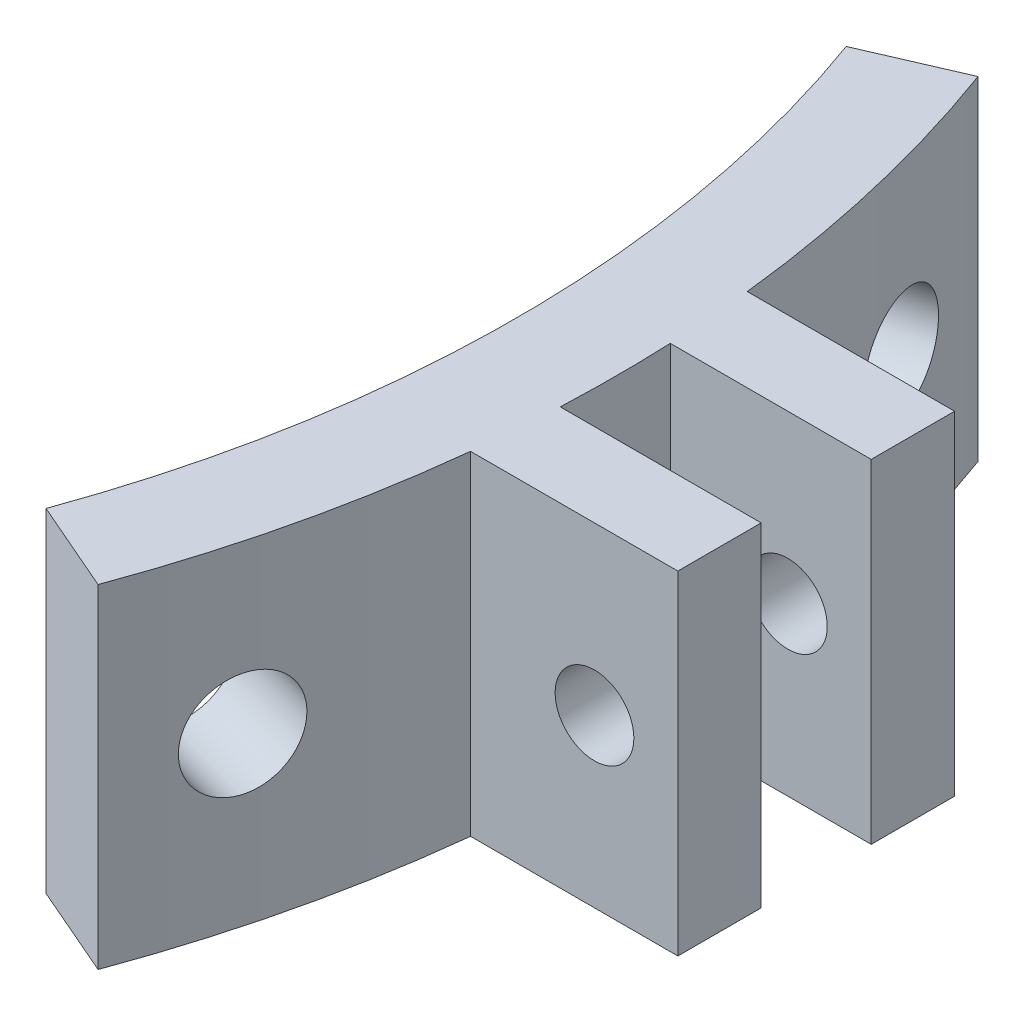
from build123d import *

# Parameters (mm, degrees)
SKETCH1_R               = 48.514
SKETCH1_R_2             = 44.704
BOSS_EXTRUDE1_DEPTH     = 6.35
BOSS_EXTRUDE2_DEPTH     = 6.35
SKETCH4_R               = 1.5
CUT_EXTRUDE1_DEPTH      = 75.456114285
CIRPATTERN1_COUNT       = 4
CUT_EXTRUDE2_DEPTH      = 80.623407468
CUT_EXTRUDE2_DEPTH_BACK = 80.623407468
CUT_EXTRUDE3_REACH      = 33.392
CUT_EXTRUDE3_END_RADIUS = 44.704
SKETCH7_R               = 2


with BuildPart() as part:
    # Sketch1 → Boss-Extrude1 (new, symmetric)
    with BuildSketch(Plane(origin=(0, 0, 0), x_dir=(1, 0, 0), z_dir=(0, 1, 0))):
        with Locations(Location((0, 0, 0), (0, 0, 270))):
            Circle(SKETCH1_R)
        with Locations(Location((0, 0, 0), (0, 0, 270))):
            Circle(SKETCH1_R_2, mode=Mode.SUBTRACT)
    extrude(amount=BOSS_EXTRUDE1_DEPTH, both=True)

    # Sketch2 → Boss-Extrude2 (add, symmetric)
    with BuildSketch(Plane(origin=(0, 0, 0), x_dir=(1, 0, 0), z_dir=(0, 1, 0))):
        with BuildLine():
            Line((48.468722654, -2.0955), (56.122920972, -2.0955))
            Line((56.122920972, -2.0955), (56.122920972, -5.2705))
            Line((56.122920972, -5.2705), (48.226860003, -5.2705))
            ThreePointArc((48.226860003, -5.2705), (48.373847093, -3.684984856), (48.468722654, -2.0955))
        make_face()
    boss_extrude2 = extrude(amount=BOSS_EXTRUDE2_DEPTH, both=True)

    # Mirror2: Boss-Extrude2 across plane
    add(boss_extrude2.mirror(Plane.XY))

    # Sketch4 → Cut-Extrude1 (cut, symmetric)
    with BuildSketch(Plane.XY):
        with Locations((52.947920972, 0)):
            Circle(SKETCH4_R)
    cut_extrude1 = extrude(amount=CUT_EXTRUDE1_DEPTH, both=True, mode=Mode.SUBTRACT)

    # CirPattern1: Boss-Extrude2, Cut-Extrude1 ×4 about axis
    cirpattern1_axis = Axis((0, 0, 0), (0, 1, 0))
    add([boss_extrude2.rotate(cirpattern1_axis, i * 360 / CIRPATTERN1_COUNT) for i in range(1, CIRPATTERN1_COUNT)])
    add([cut_extrude1.rotate(cirpattern1_axis, i * 360 / CIRPATTERN1_COUNT) for i in range(1, CIRPATTERN1_COUNT)], mode=Mode.SUBTRACT)

    # Sketch5 → Cut-Extrude2 (cut, two sides: drawn at the far end of the back side and taken through both)
    with BuildSketch(Plane(origin=(0, 0, 0), x_dir=(1, 0, 0), z_dir=(0, 1, 0)).offset(-CUT_EXTRUDE2_DEPTH_BACK)):
        with BuildLine():
            Line((42.026063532, 15.24), (53.678360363, 20.291136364))
            ThreePointArc((53.678360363, 20.291136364), (-57.385508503, 0), (53.678360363, -20.291136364))
            Line((53.678360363, -20.291136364), (42.026063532, -15.24))
            ThreePointArc((42.026063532, -15.24), (-44.704, 0), (42.026063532, 15.24))
        make_face()
    extrude(amount=CUT_EXTRUDE2_DEPTH + CUT_EXTRUDE2_DEPTH_BACK, mode=Mode.SUBTRACT)

    # Cut-Extrude3: up to this cylinder (the profile starts outside it)
    cut_extrude3_end = Plane(origin=(0, 0, 0), z_dir=(0, -1, 0)) * Cylinder(CUT_EXTRUDE3_END_RADIUS, 157.192, mode=Mode.PRIVATE)
    # Sketch7 → Cut-Extrude3 (cut, up to the surface)
    with BuildSketch(Plane(origin=(46.860925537, 0, 12.556347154), x_dir=(0.25881904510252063, 0, -0.9659258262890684), z_dir=(0.9659258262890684, 0, 0.25881904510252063)), mode=Mode.PRIVATE) as cut_extrude3_sk1:
        Circle(SKETCH7_R)
    cut_extrude3_tool1 = extrude(cut_extrude3_sk1.sketch, amount=-CUT_EXTRUDE3_REACH, mode=Mode.PRIVATE) - cut_extrude3_end
    cut_extrude3 = cut_extrude3_tool1.solids().sort_by_distance((46.860926, 0, 12.556347))[0]
    add(cut_extrude3, mode=Mode.SUBTRACT)

    # Mirror1: Cut-Extrude3 across plane
    add(cut_extrude3.mirror(Plane.XY), mode=Mode.SUBTRACT)


solid = part.part
